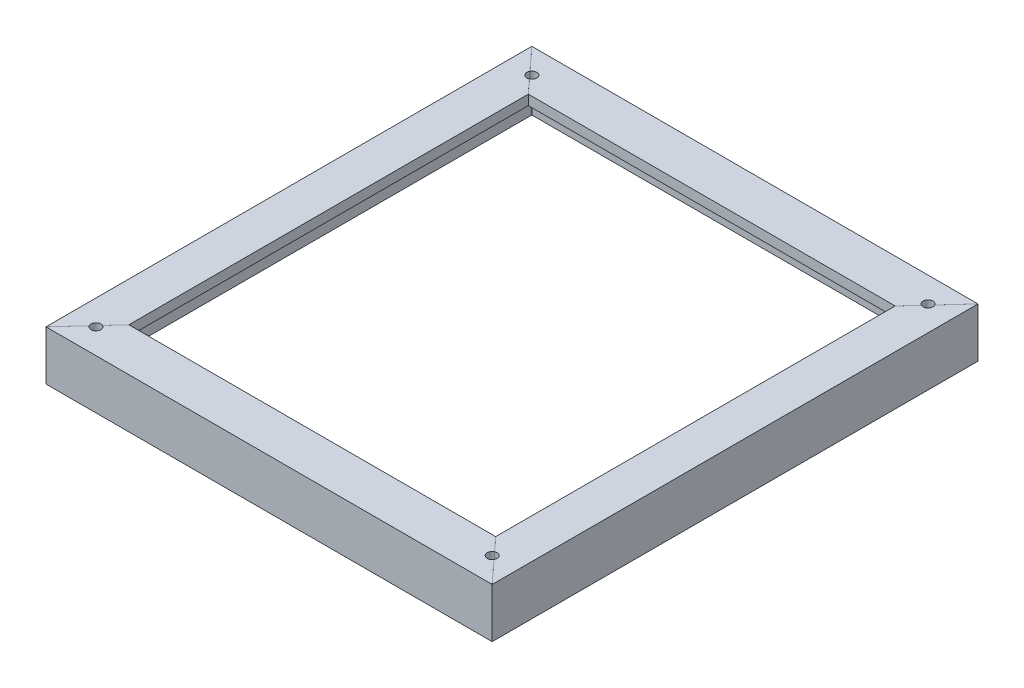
from build123d import *

# Parameters (mm, degrees)
SKETCH1_W           = 142.875
SKETCH1_H           = 155.575
SKETCH1_W_2         = 117.475
SKETCH1_H_2         = 127.917222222
BOSS_EXTRUDE1_DEPTH = 3.175
SKETCH2_W           = 142.875
SKETCH2_H           = 155.575
SKETCH2_W_2         = 136.525
SKETCH2_H_2         = 149.225
BOSS_EXTRUDE2_DEPTH = 12.7
SKETCH7_R           = 1.59004
CUT_EXTRUDE5_DEPTH  = 107.374346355
CUT_EXTRUDE8_DEPTH  = 2540


with BuildPart() as part:
    # Sketch1 → Boss-Extrude1 (new body)
    with BuildSketch(Plane(origin=(0, 0, 0), x_dir=(1, 0, 0), z_dir=(0, 1, 0))):
        Rectangle(SKETCH1_W, SKETCH1_H)
        Rectangle(SKETCH1_W_2, SKETCH1_H_2, mode=Mode.SUBTRACT)
    extrude(amount=-BOSS_EXTRUDE1_DEPTH)

    # Sketch2 → Boss-Extrude2 (add)
    with BuildSketch(Plane.XZ.offset(3.175)):
        Rectangle(SKETCH2_W, SKETCH2_H)
        Rectangle(SKETCH2_W_2, SKETCH2_H_2, mode=Mode.SUBTRACT)
    extrude(amount=BOSS_EXTRUDE2_DEPTH)

    # Sketch7 → Cut-Extrude5 (cut, through all)
    with BuildSketch(Plane.XZ.offset(3.175)):
        with Locations(Location((-63.4365, 69.7865, 0), (0, 0, 270))):
            Circle(SKETCH7_R)
        with Locations(Location((-63.4365, -69.7865, 0), (0, 0, 270))):
            Circle(SKETCH7_R)
        with Locations(Location((63.4365, -69.7865, 0), (0, 0, 90))):
            Circle(SKETCH7_R)
        with Locations(Location((63.4365, 69.7865, 0), (0, 0, 90))):
            Circle(SKETCH7_R)
    extrude(amount=-CUT_EXTRUDE5_DEPTH, mode=Mode.SUBTRACT)

    # Sketch10 → Cut-Extrude8 (cut)
    with BuildSketch(Plane(origin=(0, 0, 0), x_dir=(1, 0, 0), z_dir=(0, 1, 0))):
        Polygon((-71.439370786, 77.785781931), (-0.003448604, 0), (-71.439370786, -77.785781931), (-71.435629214, -77.789218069), (0, -0.003755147), (71.435629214, -77.789218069), (71.439370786, -77.785781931), (0.003448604, 0), (71.439370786, 77.785781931), (71.435629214, 77.789218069), (0, 0.003755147), (-71.435629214, 77.789218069), align=None)
    extrude(amount=-CUT_EXTRUDE8_DEPTH, mode=Mode.SUBTRACT)


with BuildPart() as cut_extrude8_piece_1:
    # of the separate pieces the step leaves, piece 1, a body of its own (cut_extrude8_pieces)
    add(part.part.solids().sort_by_distance((71.4375, -15.875, -77.783744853))[0])


with BuildPart() as cut_extrude8_piece_2:
    # of the separate pieces the step leaves, piece 2, a body of its own (cut_extrude8_pieces)
    add(part.part.solids().sort_by_distance((-64.817245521, 0, 70.575023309))[0])


with BuildPart() as cut_extrude8_piece_3:
    # of the separate pieces the step leaves, piece 3, a body of its own (cut_extrude8_pieces)
    add(part.part.solids().sort_by_distance((71.434051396, -15.875, 77.7875))[0])


with BuildPart() as cut_extrude8_piece_4:
    # of the separate pieces the step leaves, piece 4, a body of its own (cut_extrude8_pieces)
    add(part.part.solids().sort_by_distance((-71.434051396, 0, -77.7875))[0])


solid = Compound([cut_extrude8_piece_1.part, cut_extrude8_piece_2.part, cut_extrude8_piece_3.part, cut_extrude8_piece_4.part])
